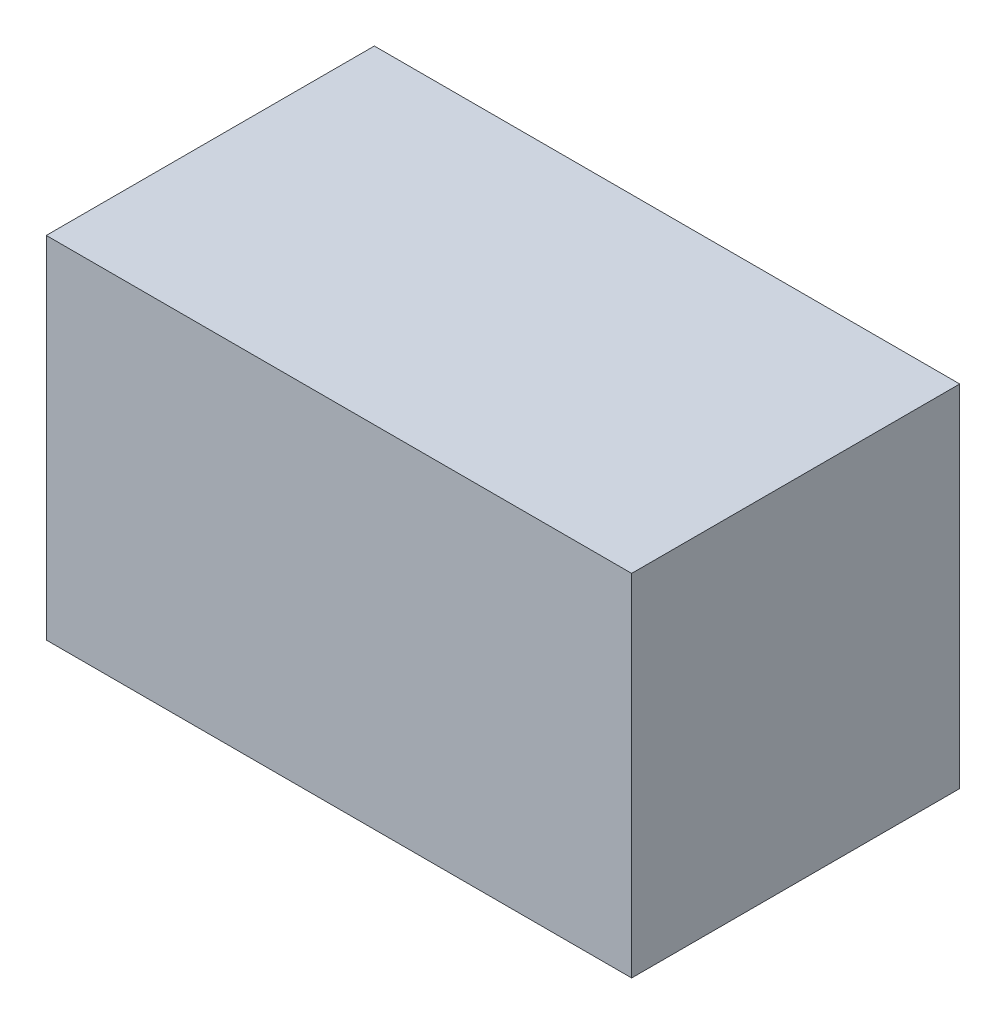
from build123d import *

# Parameters (mm, degrees)
SKETCH2_W           = 219.373638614
SKETCH2_H           = 122.945665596
BOSS_EXTRUDE1_DEPTH = 131.318
SHELL1_T            = 2.54


with BuildPart() as part:
    # Sketch2 → Boss-Extrude1 (new body)
    with BuildSketch(Plane(origin=(0, 0, 0), x_dir=(1, 0, 0), z_dir=(0, 1, 0))):
        Rectangle(SKETCH2_W, SKETCH2_H)
    extrude(amount=BOSS_EXTRUDE1_DEPTH)

    # Shell1 (no face opened: a closed hollow body)
    add(offset(amount=-SHELL1_T, mode=Mode.PRIVATE), mode=Mode.SUBTRACT)


solid = part.part
